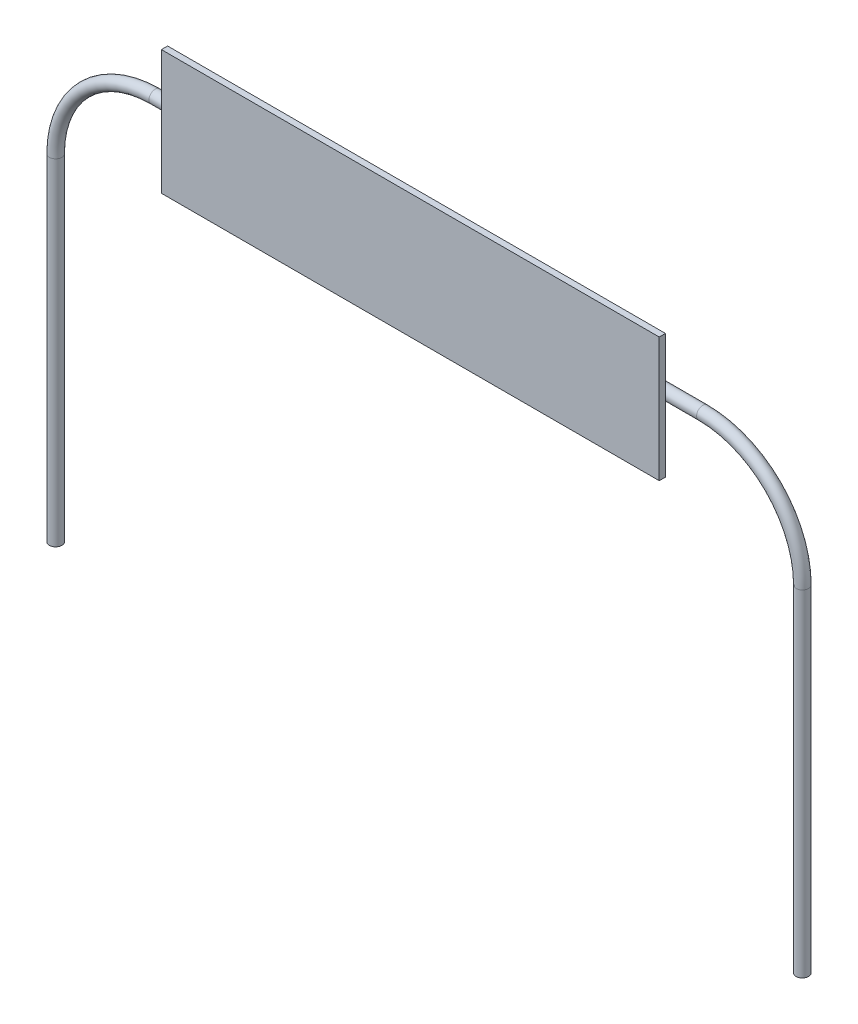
from build123d import *

# Parameters (mm, degrees)
BOSS_EXTRUDE1_START = 304.8
SKETCH1_W           = 12192
SKETCH1_H           = 3048
BOSS_EXTRUDE1_DEPTH = 152.4
SKETCH4_R           = 152.4
BOSS_EXTRUDE4_START = 2438.4
BOSS_EXTRUDE4_DEPTH = 457.2


with BuildPart() as part:
    # Sketch1 → Boss-Extrude1 (new body)
    with BuildSketch(Plane.XY.offset(BOSS_EXTRUDE1_START)):
        Rectangle(SKETCH1_W, SKETCH1_H)
    extrude(amount=BOSS_EXTRUDE1_DEPTH)


with BuildPart() as body_2:
    # Sweep2: sweep along a path in Sketch2
    with BuildLine(Plane.XY) as sweep2_path:
        Line((-9144, -10668), (-9144, -2438.4))
        ThreePointArc((-9144, -2438.4), (-8429.809175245, -714.190824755), (-6705.6, 0))
        Line((-6705.6, 0), (6705.6, 0))
        ThreePointArc((6705.6, 0), (8429.809175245, -714.190824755), (9144, -2438.4))
        Line((9144, -2438.4), (9144, -10668))
    # Sketch4 → Sweep2 (sweep)
    with BuildSketch(Plane(origin=(0, -10668, 0), x_dir=(-1, 0, 0), z_dir=(0, 1, 0))):
        with Locations((-9144, 0)):
            Circle(SKETCH4_R)
    sweep(path=sweep2_path.line)


with BuildPart() as body_3:
    # Sketch5 → Boss-Extrude4 (new body)
    with BuildSketch(Plane(origin=(0, 0, 0), x_dir=(0, 0, -1), z_dir=(1, 0, 0)).offset(BOSS_EXTRUDE4_START)):
        with BuildLine():
            Line((0, 152.4), (-182.88, 152.4))
            ThreePointArc((-182.88, 152.4), (-269.090458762, 188.109541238), (-304.8, 274.32))
            Line((-304.8, 274.32), (-304.8, 457.2))
            Line((-304.8, 457.2), (-213.36, 457.2))
            Line((-213.36, 457.2), (-213.36, 274.32))
            ThreePointArc((-213.36, 274.32), (-204.432614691, 252.767385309), (-182.88, 243.84))
            Line((-182.88, 243.84), (0, 243.84))
            ThreePointArc((0, 243.84), (243.84, 0), (0, -243.84))
            Line((0, -243.84), (-30.48, -243.84))
            ThreePointArc((-30.48, -243.84), (-52.032614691, -252.767385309), (-60.96, -274.32))
            Line((-60.96, -274.32), (-60.96, -457.2))
            Line((-60.96, -457.2), (-152.4, -457.2))
            Line((-152.4, -457.2), (-152.4, -274.32))
            ThreePointArc((-152.4, -274.32), (-116.690458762, -188.109541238), (-30.48, -152.4))
            Line((-30.48, -152.4), (0, -152.4))
            ThreePointArc((0, -152.4), (152.4, 0), (0, 152.4))
        make_face()
    extrude(amount=BOSS_EXTRUDE4_DEPTH)


with BuildPart() as body_4:
    # Mirror1: mirrored copy
    add(body_3.part.mirror(Plane(origin=(0, 0, 0), x_dir=(0, 0, -1), z_dir=(1, 0, 0))))


solid = Compound([part.part, body_2.part, body_3.part, body_4.part])
